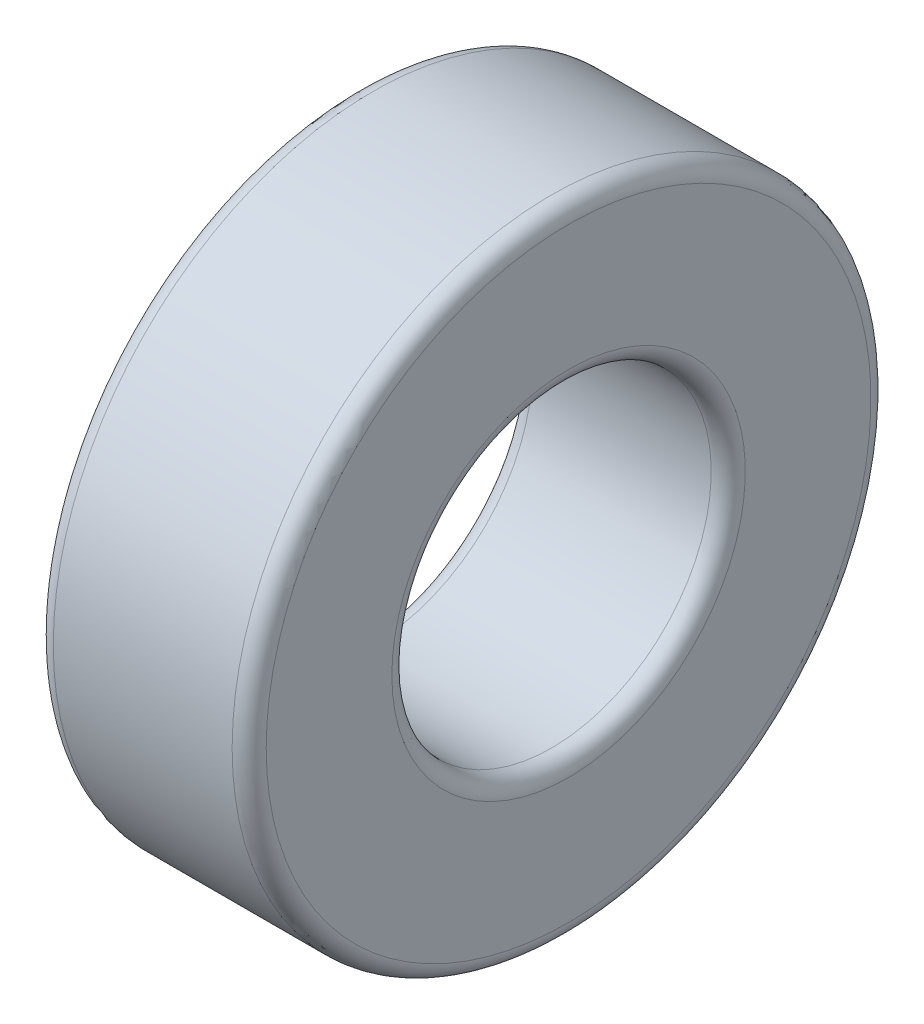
ISO-10303-21;
HEADER;
FILE_DESCRIPTION(('STEP AP214'),'2;1');
FILE_NAME('part.step','',(''),(''),'','','');
FILE_SCHEMA(('AUTOMOTIVE_DESIGN { 1 0 10303 214 1 1 1 1 }'));
ENDSEC;
DATA;
#1=APPLICATION_CONTEXT('core data for automotive mechanical design processes');
#2=APPLICATION_PROTOCOL_DEFINITION('international standard','automotive_design',2000,#1);
#3=PRODUCT_CONTEXT('',#1,'mechanical');
#4=PRODUCT('Part','Part','',(#3));
#5=PRODUCT_RELATED_PRODUCT_CATEGORY('part','',(#4));
#6=PRODUCT_DEFINITION_FORMATION('','',#4);
#7=PRODUCT_DEFINITION_CONTEXT('part definition',#1,'design');
#8=PRODUCT_DEFINITION('design','',#6,#7);
#9=PRODUCT_DEFINITION_SHAPE('','',#8);
#10=(LENGTH_UNIT() NAMED_UNIT(*) SI_UNIT(.MILLI.,.METRE.));
#11=(NAMED_UNIT(*) PLANE_ANGLE_UNIT() SI_UNIT($,.RADIAN.));
#12=(NAMED_UNIT(*) SI_UNIT($,.STERADIAN.) SOLID_ANGLE_UNIT());
#13=UNCERTAINTY_MEASURE_WITH_UNIT(LENGTH_MEASURE(1.E-05),#10,'distance_accuracy_value','');
#14=(GEOMETRIC_REPRESENTATION_CONTEXT(3) GLOBAL_UNCERTAINTY_ASSIGNED_CONTEXT((#13)) GLOBAL_UNIT_ASSIGNED_CONTEXT((#10,
#11,#12)) REPRESENTATION_CONTEXT('',''));
#15=CARTESIAN_POINT('',(0.,0.,0.));
#16=DIRECTION('',(0.,0.,1.));
#17=DIRECTION('',(1.,0.,0.));
#18=AXIS2_PLACEMENT_3D('',#15,#16,#17);
#19=CARTESIAN_POINT('',(-1.5875,2.38125,0.));
#20=DIRECTION('',(1.,0.,0.));
#21=DIRECTION('',(0.,0.,-1.));
#22=AXIS2_PLACEMENT_3D('',#19,#20,#21);
#23=PLANE('',#22);
#24=CARTESIAN_POINT('',(-1.5875,0.,0.));
#25=DIRECTION('',(1.,0.,0.));
#26=DIRECTION('',(0.,0.,-1.));
#27=AXIS2_PLACEMENT_3D('',#24,#25,#26);
#28=CIRCLE('',#27,4.5085);
#29=CARTESIAN_POINT('',(-1.5875,0.,-4.5085));
#30=VERTEX_POINT('',#29);
#31=EDGE_CURVE('E57',#30,#30,#28,.F.);
#32=ORIENTED_EDGE('',*,*,#31,.T.);
#33=EDGE_LOOP('',(#32));
#34=FACE_BOUND('',#33,.T.);
#35=CARTESIAN_POINT('',(-1.5875,0.,0.));
#36=DIRECTION('',(1.,0.,0.));
#37=DIRECTION('',(0.,0.,-1.));
#38=AXIS2_PLACEMENT_3D('',#35,#36,#37);
#39=CIRCLE('',#38,2.63525);
#40=CARTESIAN_POINT('',(-1.5875,0.,-2.63525));
#41=VERTEX_POINT('',#40);
#42=EDGE_CURVE('E60',#41,#41,#39,.T.);
#43=ORIENTED_EDGE('',*,*,#42,.T.);
#44=EDGE_LOOP('',(#43));
#45=FACE_BOUND('',#44,.T.);
#46=ADVANCED_FACE('F32',(#34,#45),#23,.F.);
#47=CARTESIAN_POINT('',(0.,0.,0.));
#48=DIRECTION('',(-1.,0.,0.));
#49=DIRECTION('',(0.,0.,1.));
#50=AXIS2_PLACEMENT_3D('',#47,#48,#49);
#51=CYLINDRICAL_SURFACE('',#50,4.7625);
#52=CARTESIAN_POINT('',(-1.3335,0.,0.));
#53=DIRECTION('',(1.,0.,0.));
#54=DIRECTION('',(0.,0.,-1.));
#55=AXIS2_PLACEMENT_3D('',#52,#53,#54);
#56=CIRCLE('',#55,4.7625);
#57=CARTESIAN_POINT('',(-1.3335,0.,-4.7625));
#58=VERTEX_POINT('',#57);
#59=EDGE_CURVE('E51',#58,#58,#56,.T.);
#60=ORIENTED_EDGE('',*,*,#59,.T.);
#61=EDGE_LOOP('',(#60));
#62=FACE_BOUND('',#61,.T.);
#63=CARTESIAN_POINT('',(1.3335,0.,0.));
#64=DIRECTION('',(-1.,0.,0.));
#65=DIRECTION('',(0.,0.,1.));
#66=AXIS2_PLACEMENT_3D('',#63,#64,#65);
#67=CIRCLE('',#66,4.7625);
#68=CARTESIAN_POINT('',(1.3335,0.,4.7625));
#69=VERTEX_POINT('',#68);
#70=EDGE_CURVE('E54',#69,#69,#67,.T.);
#71=ORIENTED_EDGE('',*,*,#70,.T.);
#72=EDGE_LOOP('',(#71));
#73=FACE_BOUND('',#72,.T.);
#74=ADVANCED_FACE('F90',(#62,#73),#51,.T.);
#75=CARTESIAN_POINT('',(1.5875,2.38125,0.));
#76=DIRECTION('',(-1.,0.,0.));
#77=DIRECTION('',(0.,0.,1.));
#78=AXIS2_PLACEMENT_3D('',#75,#76,#77);
#79=PLANE('',#78);
#80=CARTESIAN_POINT('',(1.5875,0.,0.));
#81=DIRECTION('',(-1.,0.,0.));
#82=DIRECTION('',(0.,0.,1.));
#83=AXIS2_PLACEMENT_3D('',#80,#81,#82);
#84=CIRCLE('',#83,4.5085);
#85=CARTESIAN_POINT('',(1.5875,0.,4.5085));
#86=VERTEX_POINT('',#85);
#87=EDGE_CURVE('E10',#86,#86,#84,.F.);
#88=ORIENTED_EDGE('',*,*,#87,.T.);
#89=EDGE_LOOP('',(#88));
#90=FACE_BOUND('',#89,.T.);
#91=CARTESIAN_POINT('',(1.5875,0.,0.));
#92=DIRECTION('',(-1.,0.,0.));
#93=DIRECTION('',(0.,0.,1.));
#94=AXIS2_PLACEMENT_3D('',#91,#92,#93);
#95=CIRCLE('',#94,2.63525);
#96=CARTESIAN_POINT('',(1.5875,0.,2.63525));
#97=VERTEX_POINT('',#96);
#98=EDGE_CURVE('E38',#97,#97,#95,.T.);
#99=ORIENTED_EDGE('',*,*,#98,.T.);
#100=EDGE_LOOP('',(#99));
#101=FACE_BOUND('',#100,.T.);
#102=ADVANCED_FACE('F76',(#90,#101),#79,.F.);
#103=CARTESIAN_POINT('',(0.,0.,0.));
#104=DIRECTION('',(-1.,0.,0.));
#105=DIRECTION('',(0.,0.,1.));
#106=AXIS2_PLACEMENT_3D('',#103,#104,#105);
#107=CYLINDRICAL_SURFACE('',#106,2.38125);
#108=CARTESIAN_POINT('',(-1.3335,0.,0.));
#109=DIRECTION('',(1.,0.,0.));
#110=DIRECTION('',(0.,0.,-1.));
#111=AXIS2_PLACEMENT_3D('',#108,#109,#110);
#112=CIRCLE('',#111,2.38125);
#113=CARTESIAN_POINT('',(-1.3335,0.,-2.38125));
#114=VERTEX_POINT('',#113);
#115=EDGE_CURVE('E42',#114,#114,#112,.F.);
#116=ORIENTED_EDGE('',*,*,#115,.T.);
#117=EDGE_LOOP('',(#116));
#118=FACE_BOUND('',#117,.T.);
#119=CARTESIAN_POINT('',(1.3335,0.,0.));
#120=DIRECTION('',(-1.,0.,0.));
#121=DIRECTION('',(0.,0.,1.));
#122=AXIS2_PLACEMENT_3D('',#119,#120,#121);
#123=CIRCLE('',#122,2.38125);
#124=CARTESIAN_POINT('',(1.3335,0.,2.38125));
#125=VERTEX_POINT('',#124);
#126=EDGE_CURVE('E46',#125,#125,#123,.F.);
#127=ORIENTED_EDGE('',*,*,#126,.T.);
#128=EDGE_LOOP('',(#127));
#129=FACE_BOUND('',#128,.T.);
#130=ADVANCED_FACE('F73',(#118,#129),#107,.F.);
#131=CARTESIAN_POINT('',(-1.3335,0.,0.));
#132=DIRECTION('',(1.,0.,0.));
#133=DIRECTION('',(0.,0.,-1.));
#134=AXIS2_PLACEMENT_3D('',#131,#132,#133);
#135=TOROIDAL_SURFACE('',#134,4.5085,0.254);
#136=ORIENTED_EDGE('',*,*,#59,.F.);
#137=EDGE_LOOP('',(#136));
#138=FACE_BOUND('',#137,.T.);
#139=ORIENTED_EDGE('',*,*,#31,.F.);
#140=EDGE_LOOP('',(#139));
#141=FACE_BOUND('',#140,.T.);
#142=ADVANCED_FACE('F69',(#138,#141),#135,.T.);
#143=CARTESIAN_POINT('',(-1.3335,0.,0.));
#144=DIRECTION('',(1.,0.,0.));
#145=DIRECTION('',(0.,0.,-1.));
#146=AXIS2_PLACEMENT_3D('',#143,#144,#145);
#147=TOROIDAL_SURFACE('',#146,2.63525,0.254);
#148=ORIENTED_EDGE('',*,*,#42,.F.);
#149=EDGE_LOOP('',(#148));
#150=FACE_BOUND('',#149,.T.);
#151=ORIENTED_EDGE('',*,*,#115,.F.);
#152=EDGE_LOOP('',(#151));
#153=FACE_BOUND('',#152,.T.);
#154=ADVANCED_FACE('F65',(#150,#153),#147,.T.);
#155=CARTESIAN_POINT('',(1.3335,0.,0.));
#156=DIRECTION('',(-1.,0.,0.));
#157=DIRECTION('',(0.,0.,1.));
#158=AXIS2_PLACEMENT_3D('',#155,#156,#157);
#159=TOROIDAL_SURFACE('',#158,4.5085,0.254);
#160=ORIENTED_EDGE('',*,*,#87,.F.);
#161=EDGE_LOOP('',(#160));
#162=FACE_BOUND('',#161,.T.);
#163=ORIENTED_EDGE('',*,*,#70,.F.);
#164=EDGE_LOOP('',(#163));
#165=FACE_BOUND('',#164,.T.);
#166=ADVANCED_FACE('F68',(#162,#165),#159,.T.);
#167=CARTESIAN_POINT('',(1.3335,0.,0.));
#168=DIRECTION('',(-1.,0.,0.));
#169=DIRECTION('',(0.,0.,1.));
#170=AXIS2_PLACEMENT_3D('',#167,#168,#169);
#171=TOROIDAL_SURFACE('',#170,2.63525,0.254);
#172=ORIENTED_EDGE('',*,*,#126,.F.);
#173=EDGE_LOOP('',(#172));
#174=FACE_BOUND('',#173,.T.);
#175=ORIENTED_EDGE('',*,*,#98,.F.);
#176=EDGE_LOOP('',(#175));
#177=FACE_BOUND('',#176,.T.);
#178=ADVANCED_FACE('F80',(#174,#177),#171,.T.);
#179=CLOSED_SHELL('',(#46,#74,#102,#130,#142,#154,#166,#178));
#180=MANIFOLD_SOLID_BREP('B2',#179);
#181=ADVANCED_BREP_SHAPE_REPRESENTATION('',(#18,#180),#14);
#182=SHAPE_DEFINITION_REPRESENTATION(#9,#181);
ENDSEC;
END-ISO-10303-21;
